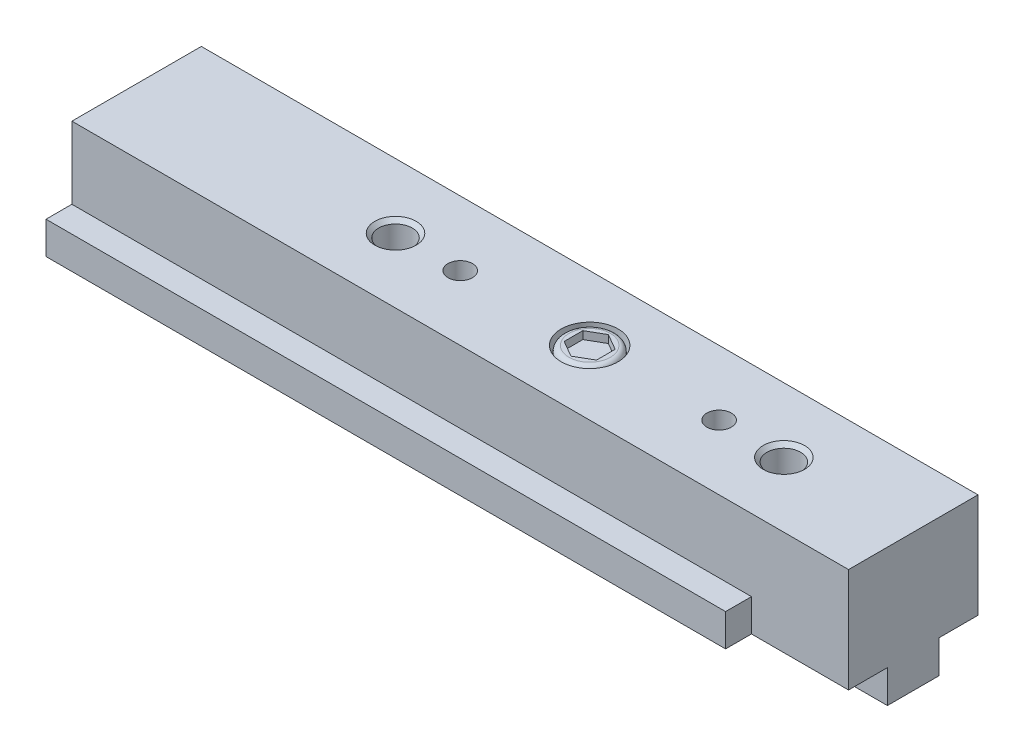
from build123d import *

# Parameters (mm, degrees)
EXTRUDE1_DEPTH     = 66.675
EXTRUDE2_DEPTH     = 9.525
SKETCH5_R          = 1.20269
CUT_EXTRUDE1_DEPTH = 3.048
SKETCH6_R          = 1.20269
CUT_EXTRUDE2_DEPTH = 3.048
SKETCH7_R          = 2.794
CUT_EXTRUDE3_DEPTH = 1.524
CUT_EXTRUDE4_DEPTH = 0.762


with BuildPart() as part:
    # Sketch1 → Extrude1 (new body)
    with BuildSketch(Plane(origin=(0, 0, 0), x_dir=(0, 0, -1), z_dir=(1, 0, 0))):
        Polygon((-8.89, 3.2258), (-2.54, 3.2258), (-2.54, 0), (2.54, 0), (2.54, 3.2258), (8.89, 3.2258), (8.89, 6.4008), (6.35, 6.4008), (6.35, 13.462), (-6.35, 13.462), (-6.35, 6.4008), (-8.89, 6.4008), align=None)
    extrude(amount=EXTRUDE1_DEPTH)

    # Sketch2 → Extrude2 (add)
    with BuildSketch(Plane(origin=(66.675, 0, 0), x_dir=(0, 0, -1), z_dir=(1, 0, 0))):
        Polygon((-6.35, 3.2258), (-2.54, 3.2258), (-2.54, 0), (2.54, 0), (2.54, 3.2258), (6.35, 3.2258), (6.35, 13.462), (-6.35, 13.462), align=None)
    extrude(amount=EXTRUDE2_DEPTH)

    # Sketch3 → Cut-Revolve1 (revolve, cut)
    with BuildSketch(Plane(origin=(63.5, 0, 0), x_dir=(0, 0, -1), z_dir=(1, 0, 0)), mode=Mode.PRIVATE) as cut_revolve1_sk:
        Polygon((0, 13.462), (2.032, 13.462), (1.651, 13.081), (1.651, 6.160205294), (0, 5.207), align=None)
    revolve(cut_revolve1_sk.sketch.rotate(Axis((63.5, 5.207, 0), (0, 1, 0)), 180), axis=Axis((63.5, 5.207, 0), (0, 1, 0)), mode=Mode.SUBTRACT)

    # Sketch4 → Cut-Revolve2 (revolve, cut)
    with BuildSketch(Plane(origin=(25.4, 0, 0), x_dir=(0, 0, -1), z_dir=(1, 0, 0)), mode=Mode.PRIVATE) as cut_revolve2_sk:
        Polygon((0, 13.462), (2.032, 13.462), (1.651, 13.081), (1.651, 8.065205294), (0, 7.112), align=None)
    revolve(cut_revolve2_sk.sketch.rotate(Axis((25.4, 7.112, 0), (0, 1, 0)), 180), axis=Axis((25.4, 7.112, 0), (0, 1, 0)), mode=Mode.SUBTRACT)

    # Sketch5 → Cut-Extrude1 (cut)
    with BuildSketch(Plane(origin=(0, 13.462, 0), x_dir=(-1, 0, 0), z_dir=(0, 1, 0))):
        with Locations(Location((-57.15, 0, 0), (0, 0, 90))):
            Circle(SKETCH5_R)
    extrude(amount=-CUT_EXTRUDE1_DEPTH, mode=Mode.SUBTRACT)

    # Sketch6 → Cut-Extrude2 (cut)
    with BuildSketch(Plane(origin=(0, 13.462, 0), x_dir=(-1, 0, 0), z_dir=(0, 1, 0))):
        with Locations(Location((-31.75, 0, 0), (0, 0, 90))):
            Circle(SKETCH6_R)
    extrude(amount=-CUT_EXTRUDE2_DEPTH, mode=Mode.SUBTRACT)

    # Sketch7 → Cut-Extrude3 (cut)
    with BuildSketch(Plane(origin=(0, 13.462, 0), x_dir=(-1, 0, 0), z_dir=(0, 1, 0))):
        with Locations(Location((-44.45, 0, 0), (0, 0, 90))):
            Circle(SKETCH7_R)
    extrude(amount=-CUT_EXTRUDE3_DEPTH, mode=Mode.SUBTRACT)

    # Sketch8 → Revolve1 (revolve)
    with BuildSketch(Plane(origin=(44.45, 0, 0), x_dir=(0, 0, -1), z_dir=(1, 0, 0)), mode=Mode.PRIVATE) as revolve1_sk:
        with BuildLine():
            Line((0, 13.462), (2.032, 13.462))
            ThreePointArc((2.032, 13.462), (2.391210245, 13.313210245), (2.54, 12.954))
            Line((2.54, 12.954), (2.54, 11.938))
            Line((2.54, 11.938), (0, 11.938))
            Line((0, 11.938), (0, 13.462))
        make_face()
    revolve(revolve1_sk.sketch.rotate(Axis((44.45, 11.938, 0), (0, 1, 0)), 180), axis=Axis((44.45, 11.938, 0), (0, 1, 0)))

    # Sketch9 → Cut-Extrude4 (cut)
    with BuildSketch(Plane(origin=(0, 13.462, 0), x_dir=(-1, 0, 0), z_dir=(0, 1, 0))):
        Polygon((-42.8625, -0.916543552), (-42.8625, 0.916543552), (-44.45, 1.833087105), (-46.0375, 0.916543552), (-46.0375, -0.916543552), (-44.45, -1.833087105), align=None)
    extrude(amount=-CUT_EXTRUDE4_DEPTH, mode=Mode.SUBTRACT)


solid = part.part
